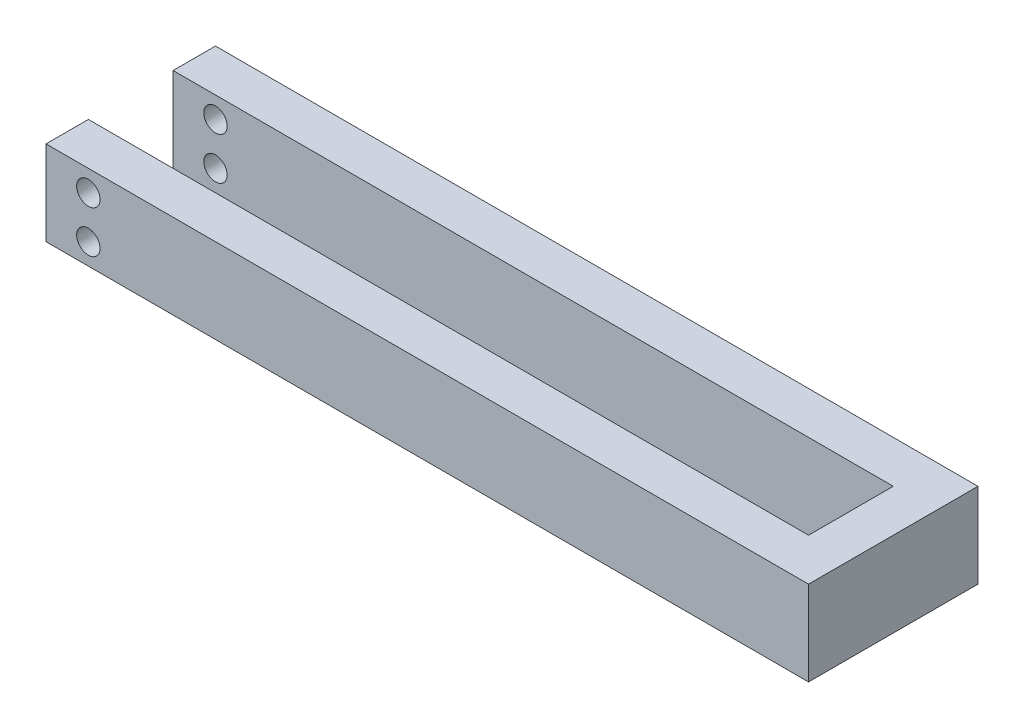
from build123d import *

# Parameters (mm, degrees)
BOSS_EXTRUDE1_DEPTH = 12.7
SKETCH2_R           = 1.7526
CUT_EXTRUDE1_DEPTH  = 25.4


with BuildPart() as part:
    # Sketch1 → Boss-Extrude1 (new body)
    with BuildSketch(Plane(origin=(0, 0, 0), x_dir=(1, 0, 0), z_dir=(0, 1, 0))):
        Polygon((-44.45, 6.35), (-50.8, 6.35), (-50.8, 12.7), (50.8, 12.7), (63.5, 12.7), (63.5, -12.7), (50.8, -12.7), (-50.8, -12.7), (-50.8, -6.35), (-44.45, -6.35), (44.45, -6.35), (57.15, -6.35), (57.15, 6.35), (44.45, 6.35), align=None)
    extrude(amount=BOSS_EXTRUDE1_DEPTH)

    # Sketch2 → Cut-Extrude1 (cut)
    with BuildSketch(Plane.XY.offset(12.7)):
        with Locations((-44.45, 9.525)):
            Circle(SKETCH2_R)
        with Locations((-44.45, 3.175)):
            Circle(SKETCH2_R)
    extrude(amount=-CUT_EXTRUDE1_DEPTH, mode=Mode.SUBTRACT)


solid = part.part
